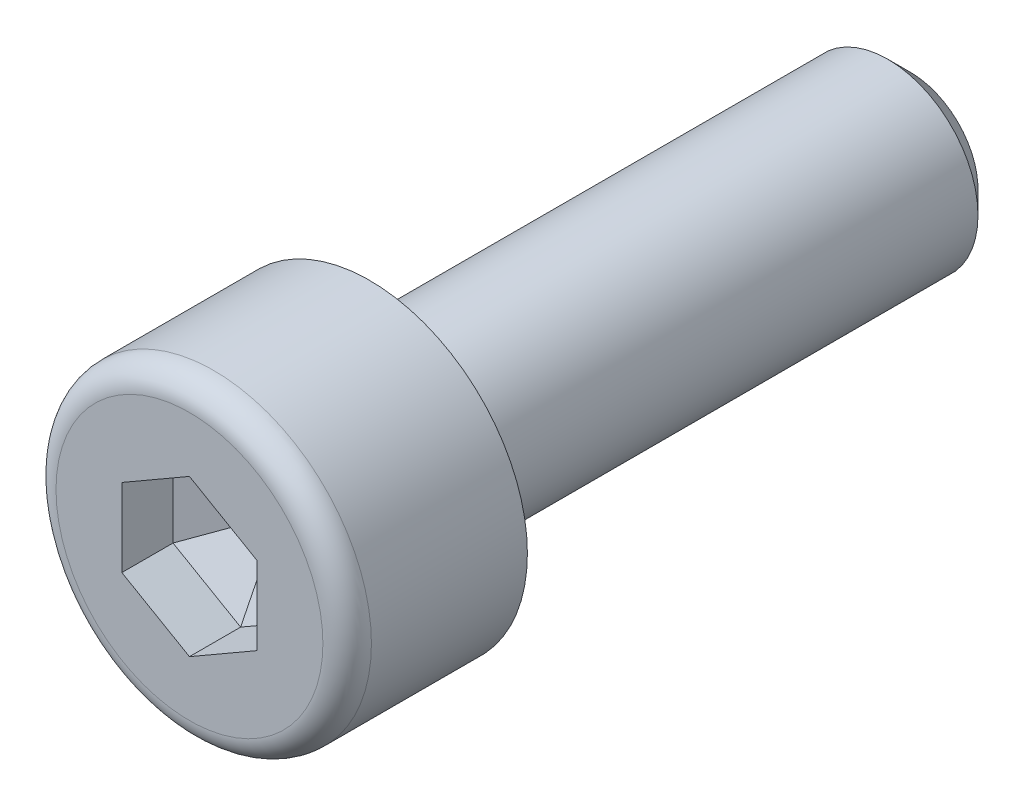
from build123d import *
from OCP.BRepFilletAPI import BRepFilletAPI_MakeChamfer

# Parameters (mm, degrees)
SKETCH_1_R          = 3.5
EXTRUDE_1_DEPTH     = 4
CUT_EXTRUDE_1_DEPTH = 2
SKETCH_3_R          = 2
EXTRUDE_2_DEPTH     = 12
CHAMFER_1_SIZE      = 0.5
FILLET_1_R          = 0.538461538
CHAMFER_2_SIZE      = 0.864553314
CHAMFER_2_SIZE2     = 1.497450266
FILLET_2_R          = 0.1


with BuildPart() as part:
    # Sketch 1 → Extrude 1 (new body)
    with BuildSketch(Plane.XY):
        Circle(SKETCH_1_R)
    extrude(amount=EXTRUDE_1_DEPTH)

    # Sketch 2 → Cut-Extrude 1 (cut)
    with BuildSketch(Plane.XY.offset(4)):
        Polygon((1.5, 0.866025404), (0, 1.732050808), (-1.5, 0.866025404), (-1.5, -0.866025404), (0, -1.732050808), (1.5, -0.866025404), align=None)
    extrude(amount=-CUT_EXTRUDE_1_DEPTH, mode=Mode.SUBTRACT)

    # Sketch 3 → Extrude 2 (add)
    with BuildSketch(Plane(origin=(0, 0, 0), x_dir=(-1, 0, 0), z_dir=(0, 0, -1))):
        with Locations(Location((0, 0, 0), (0, 0, 180))):
            Circle(SKETCH_3_R)
    extrude(amount=EXTRUDE_2_DEPTH)

    # Chamfer 1
    chamfer_1_edges = [part.edges().sort_by_distance(p)[0] for p in [
        (-2, 0, -12),
    ]]
    chamfer(chamfer_1_edges, length=CHAMFER_1_SIZE)

    # Fillet 1
    fillet_1_edges = [part.edges().sort_by_distance(p)[0] for p in [
        (-3.5, 0, 4),
    ]]
    fillet(fillet_1_edges, radius=FILLET_1_R)

    # Chamfer 2: one chamfer whose edges measure the first distance from different faces: ONE call of the kernel's chamfer builder (chamfer() names one face for all edges)
    chamfer_2_edges_1 = [part.edges().sort_by_distance(p)[0] for p in [
        (-0.75, 1.299038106, 2),
    ]]
    chamfer_2_side_1 = [part.faces().sort_by_distance(p)[0] for p in [
        (-0.75, 1.299038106, 3),
    ]]
    chamfer_2_edges_2 = [part.edges().sort_by_distance(p)[0] for p in [
        (0.75, 1.299038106, 2),
    ]]
    chamfer_2_side_2 = [part.faces().sort_by_distance(p)[0] for p in [
        (0.75, 1.299038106, 3),
    ]]
    chamfer_2_edges_3 = [part.edges().sort_by_distance(p)[0] for p in [
        (1.5, 0, 2),
    ]]
    chamfer_2_side_3 = [part.faces().sort_by_distance(p)[0] for p in [
        (1.5, 0, 3),
    ]]
    chamfer_2_edges_4 = [part.edges().sort_by_distance(p)[0] for p in [
        (0.75, -1.299038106, 2),
    ]]
    chamfer_2_side_4 = [part.faces().sort_by_distance(p)[0] for p in [
        (0.75, -1.299038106, 3),
    ]]
    chamfer_2_edges_5 = [part.edges().sort_by_distance(p)[0] for p in [
        (-0.75, -1.299038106, 2),
    ]]
    chamfer_2_side_5 = [part.faces().sort_by_distance(p)[0] for p in [
        (-0.75, -1.299038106, 3),
    ]]
    chamfer_2_edges_6 = [part.edges().sort_by_distance(p)[0] for p in [
        (-1.5, 0, 2),
    ]]
    chamfer_2_side_6 = [part.faces().sort_by_distance(p)[0] for p in [
        (-1.5, 0, 3),
    ]]
    chamfer_2 = BRepFilletAPI_MakeChamfer(part.part.solid().wrapped)
    for e in chamfer_2_edges_1:
        chamfer_2.Add(CHAMFER_2_SIZE, CHAMFER_2_SIZE2, e.wrapped, chamfer_2_side_1[0].wrapped)  # the first distance lies on this face
    for e in chamfer_2_edges_2:
        chamfer_2.Add(CHAMFER_2_SIZE, CHAMFER_2_SIZE2, e.wrapped, chamfer_2_side_2[0].wrapped)  # the first distance lies on this face
    for e in chamfer_2_edges_3:
        chamfer_2.Add(CHAMFER_2_SIZE, CHAMFER_2_SIZE2, e.wrapped, chamfer_2_side_3[0].wrapped)  # the first distance lies on this face
    for e in chamfer_2_edges_4:
        chamfer_2.Add(CHAMFER_2_SIZE, CHAMFER_2_SIZE2, e.wrapped, chamfer_2_side_4[0].wrapped)  # the first distance lies on this face
    for e in chamfer_2_edges_5:
        chamfer_2.Add(CHAMFER_2_SIZE, CHAMFER_2_SIZE2, e.wrapped, chamfer_2_side_5[0].wrapped)  # the first distance lies on this face
    for e in chamfer_2_edges_6:
        chamfer_2.Add(CHAMFER_2_SIZE, CHAMFER_2_SIZE2, e.wrapped, chamfer_2_side_6[0].wrapped)  # the first distance lies on this face
    add(Compound.cast(chamfer_2.Shape()), mode=Mode.REPLACE)

    # Fillet 2
    fillet_2_edges = [part.edges().sort_by_distance(p)[0] for p in [
        (-2, 0, 0),
    ]]
    fillet(fillet_2_edges, radius=FILLET_2_R)


solid = part.part
